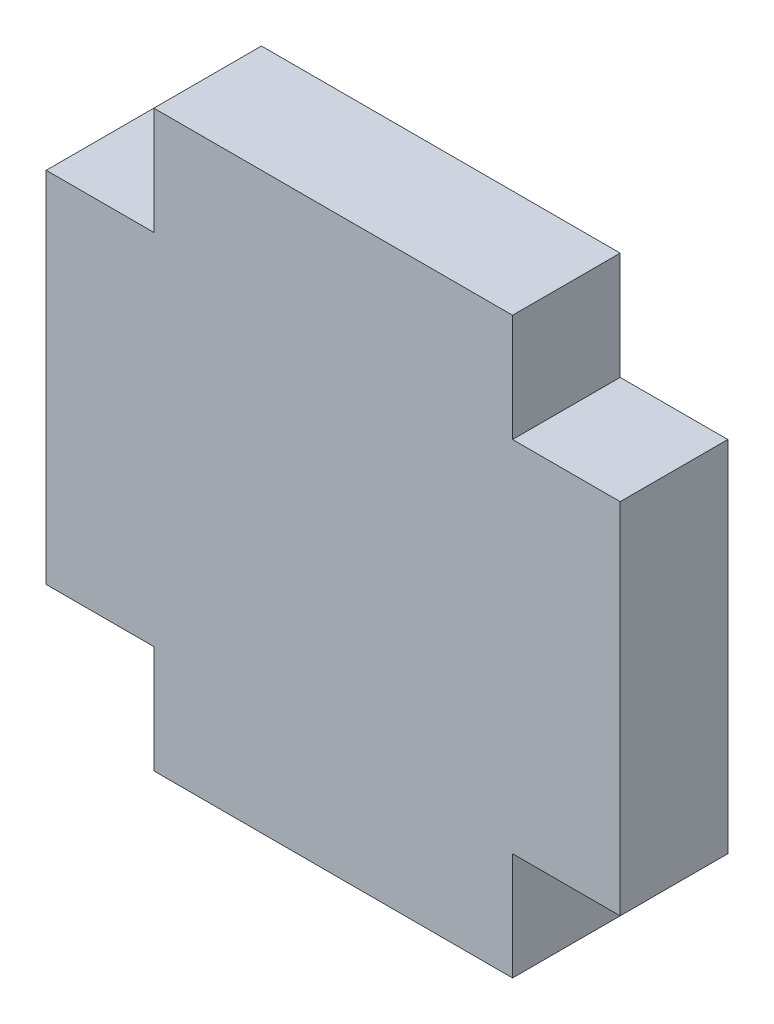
from build123d import *

# Parameters (mm, degrees)
SALIENTE_EXTRUIR1_DEPTH = 3


with BuildPart() as part:
    # Croquis2 → Saliente-Extruir1 (new body)
    with BuildSketch(Plane.XY):
        Polygon((5, 5), (8, 5), (8, -5), (5, -5), (5, -8), (-5, -8), (-5, -5), (-8, -5), (-8, 5), (-5, 5), (-5, 8), (5, 8), align=None)
    extrude(amount=SALIENTE_EXTRUIR1_DEPTH)


solid = part.part
